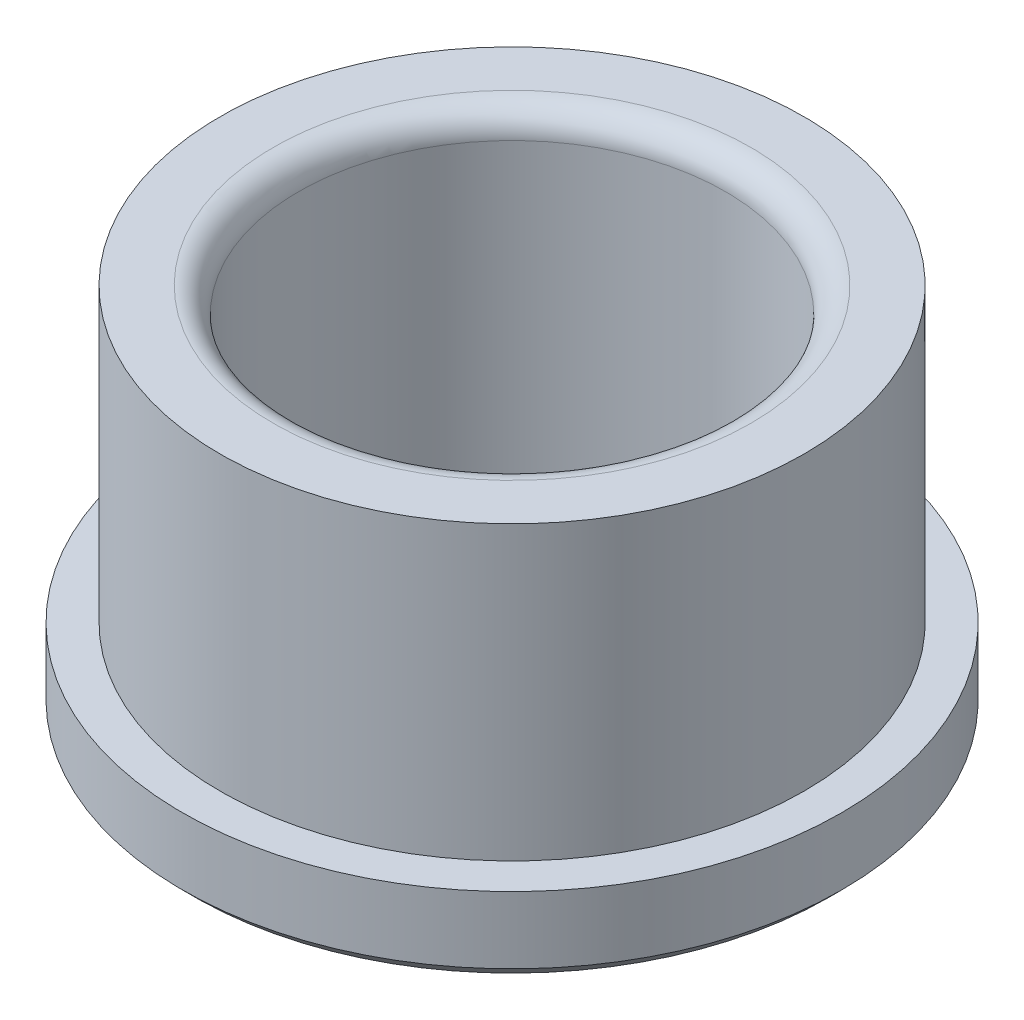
from build123d import *

# Parameters (mm, degrees)
FILLET1_R = 1.524


with BuildPart() as part:
    # Sketch1 → Revolve1 (revolve)
    with BuildSketch(Plane.XY, mode=Mode.PRIVATE) as revolve1_sk:
        Polygon((-18.9484, 0), (-19.7104, 0.762), (-19.7104, 4.7625), (-17.46885, 4.7625), (-17.46885, 22.225), (-12.7635, 22.225), (-12.7635, 0.762), (-13.5255, 0), align=None)
    revolve(revolve1_sk.sketch.rotate(Axis((0, -1000, 0), (0, 1, 0)), 180), axis=Axis((0, -1000, 0), (0, 1, 0)))

    # Fillet1
    fillet1_edges = [part.edges().sort_by_distance(p)[0] for p in [
        (-12.7635, 22.225, 0),
    ]]
    fillet(fillet1_edges, radius=FILLET1_R)


solid = part.part
